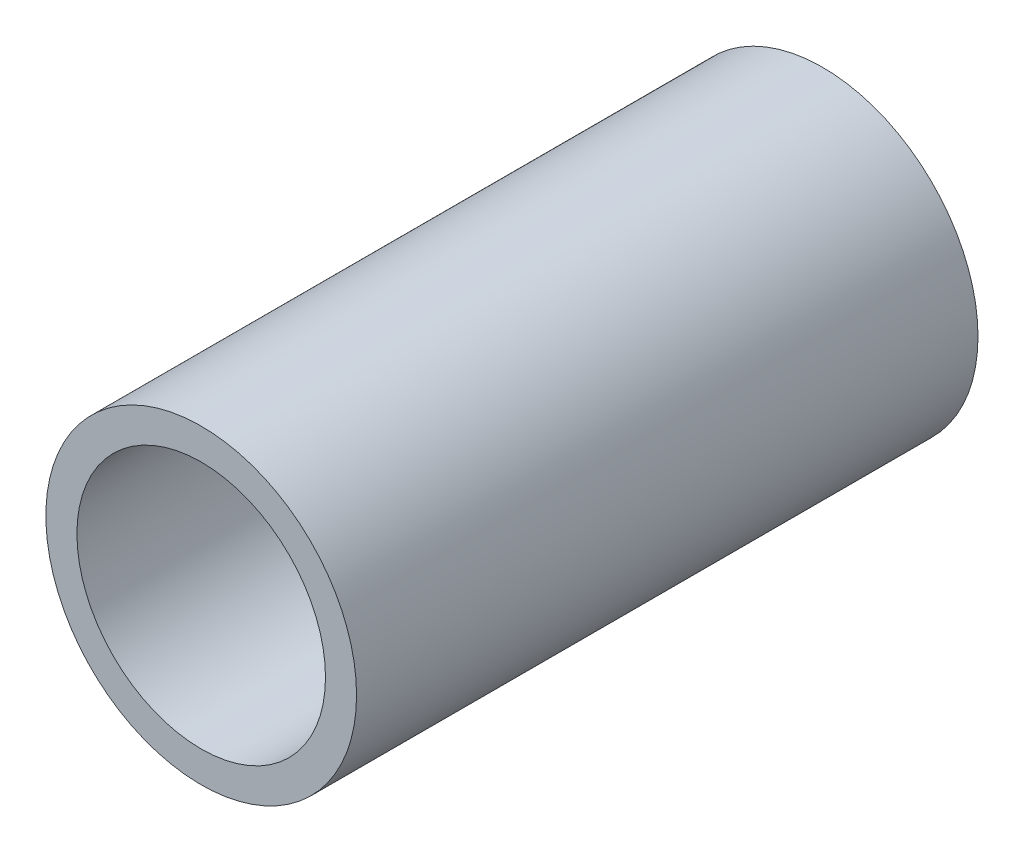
from build123d import *

# Parameters (mm, degrees)
ESQUISSE1_R             = 2
BASE_EXTRUSION_DEPTH    = 8
ESQUISSE2_R             = 1.6
ENL_V_MAT_EXTRU_1_DEPTH = 9.485281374


with BuildPart() as part:
    # Esquisse1 → Base-Extrusion (new body)
    with BuildSketch(Plane.XY):
        Circle(ESQUISSE1_R)
    extrude(amount=BASE_EXTRUSION_DEPTH)

    # Esquisse2 → Enl_v. mat.-Extru.1 (cut, through all)
    with BuildSketch(Plane.XY.offset(8)):
        Circle(ESQUISSE2_R)
    extrude(amount=-ENL_V_MAT_EXTRU_1_DEPTH, mode=Mode.SUBTRACT)


solid = part.part
